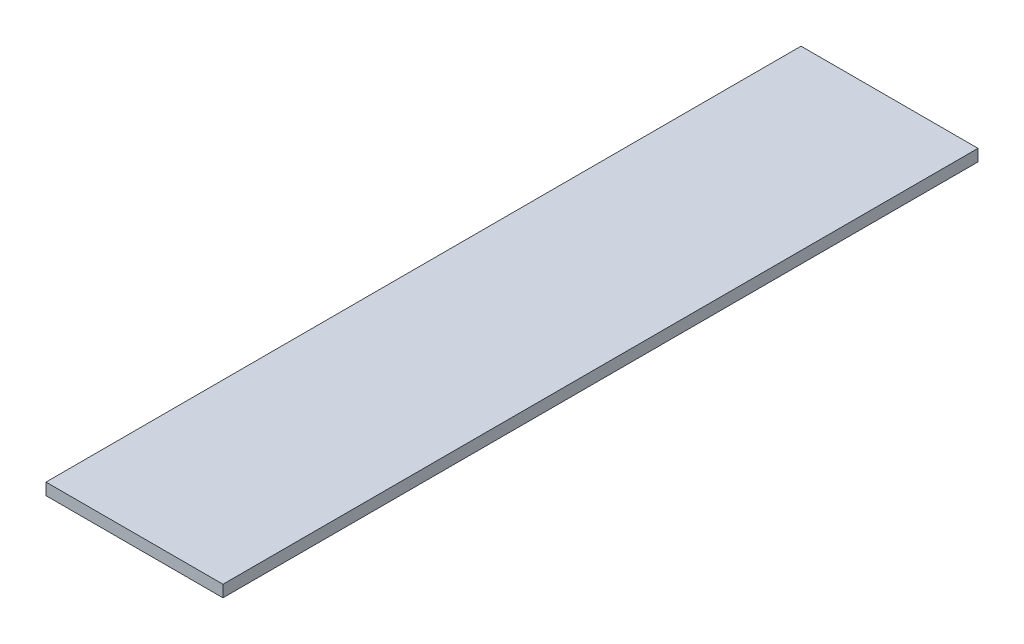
from build123d import *

# Parameters (mm, degrees)
ESQUISSE1_W      = 15
ESQUISSE1_H      = 1
EXTRUSION1_DEPTH = 64


with BuildPart() as part:
    # Esquisse1 → Extrusion1 (new body)
    with BuildSketch(Plane.XY):
        with Locations((7.5, 0.5)):
            Rectangle(ESQUISSE1_W, ESQUISSE1_H)
    extrude(amount=-EXTRUSION1_DEPTH)


solid = part.part
